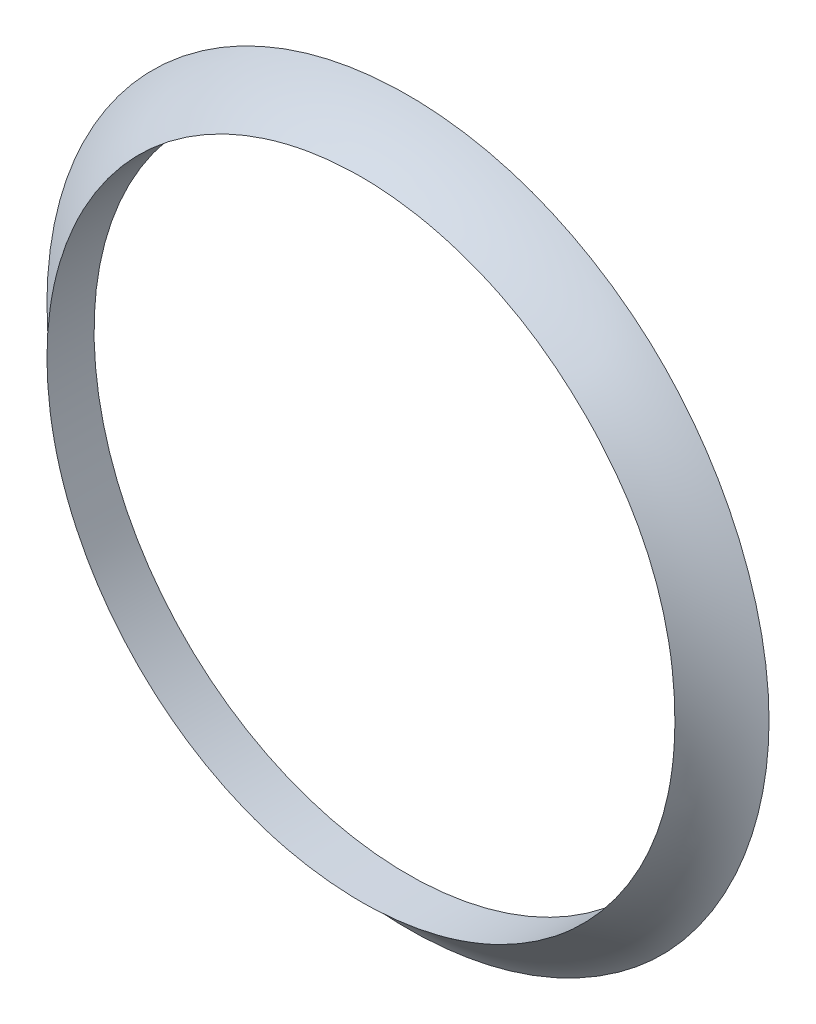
ISO-10303-21;
HEADER;
FILE_DESCRIPTION(('STEP AP214'),'2;1');
FILE_NAME('part.step','',(''),(''),'','','');
FILE_SCHEMA(('AUTOMOTIVE_DESIGN { 1 0 10303 214 1 1 1 1 }'));
ENDSEC;
DATA;
#1=APPLICATION_CONTEXT('core data for automotive mechanical design processes');
#2=APPLICATION_PROTOCOL_DEFINITION('international standard','automotive_design',2000,#1);
#3=PRODUCT_CONTEXT('',#1,'mechanical');
#4=PRODUCT('Part','Part','',(#3));
#5=PRODUCT_RELATED_PRODUCT_CATEGORY('part','',(#4));
#6=PRODUCT_DEFINITION_FORMATION('','',#4);
#7=PRODUCT_DEFINITION_CONTEXT('part definition',#1,'design');
#8=PRODUCT_DEFINITION('design','',#6,#7);
#9=PRODUCT_DEFINITION_SHAPE('','',#8);
#10=(LENGTH_UNIT() NAMED_UNIT(*) SI_UNIT(.MILLI.,.METRE.));
#11=(NAMED_UNIT(*) PLANE_ANGLE_UNIT() SI_UNIT($,.RADIAN.));
#12=(NAMED_UNIT(*) SI_UNIT($,.STERADIAN.) SOLID_ANGLE_UNIT());
#13=UNCERTAINTY_MEASURE_WITH_UNIT(LENGTH_MEASURE(1.E-05),#10,'distance_accuracy_value','');
#14=(GEOMETRIC_REPRESENTATION_CONTEXT(3) GLOBAL_UNCERTAINTY_ASSIGNED_CONTEXT((#13)) GLOBAL_UNIT_ASSIGNED_CONTEXT((#10,
#11,#12)) REPRESENTATION_CONTEXT('',''));
#15=CARTESIAN_POINT('',(0.,0.,0.));
#16=DIRECTION('',(0.,0.,1.));
#17=DIRECTION('',(1.,0.,0.));
#18=AXIS2_PLACEMENT_3D('',#15,#16,#17);
#19=CARTESIAN_POINT('',(718.031944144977,689.142048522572,-152.499999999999));
#20=DIRECTION('',(0.,0.,-0.999999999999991));
#21=DIRECTION('',(-0.453546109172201,0.89123281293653,0.));
#22=AXIS2_PLACEMENT_3D('',#19,#20,#21);
#23=CYLINDRICAL_SURFACE('',#22,20.);
#24=CARTESIAN_POINT('',(738.031944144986,689.142048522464,-160.999999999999));
#25=CARTESIAN_POINT('',(738.031940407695,688.581115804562,-160.999998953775));
#26=CARTESIAN_POINT('',(738.00832523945,688.020078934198,-161.003315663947));
#27=CARTESIAN_POINT('',(737.914015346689,686.901908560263,-161.013238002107));
#28=CARTESIAN_POINT('',(737.843307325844,686.344776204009,-161.019844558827));
#29=CARTESIAN_POINT('',(737.655207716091,685.237812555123,-161.033482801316));
#30=CARTESIAN_POINT('',(737.537764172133,684.687990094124,-161.040514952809));
#31=CARTESIAN_POINT('',(737.257003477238,683.600158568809,-161.052818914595));
#32=CARTESIAN_POINT('',(737.093689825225,683.062148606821,-161.058090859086));
#33=CARTESIAN_POINT('',(736.784244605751,682.178451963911,-161.06428323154));
#34=CARTESIAN_POINT('',(736.650499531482,681.828378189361,-161.066068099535));
#35=CARTESIAN_POINT('',(736.363547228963,681.136260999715,-161.068065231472));
#36=CARTESIAN_POINT('',(736.210339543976,680.794217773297,-161.068277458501));
#37=CARTESIAN_POINT('',(735.884958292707,680.119285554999,-161.067093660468));
#38=CARTESIAN_POINT('',(735.712784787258,679.78639653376,-161.065697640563));
#39=CARTESIAN_POINT('',(735.350056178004,679.13089097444,-161.061440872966));
#40=CARTESIAN_POINT('',(735.159505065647,678.808272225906,-161.058580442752));
#41=CARTESIAN_POINT('',(734.760594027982,678.174252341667,-161.05171652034));
#42=CARTESIAN_POINT('',(734.552234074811,677.862851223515,-161.047713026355));
#43=CARTESIAN_POINT('',(734.118361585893,677.252244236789,-161.039071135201));
#44=CARTESIAN_POINT('',(733.892848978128,676.953038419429,-161.034432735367));
#45=CARTESIAN_POINT('',(733.425571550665,676.368001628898,-161.025225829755));
#46=CARTESIAN_POINT('',(733.183820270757,676.082159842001,-161.020657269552));
#47=CARTESIAN_POINT('',(732.684655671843,675.524483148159,-161.012474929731));
#48=CARTESIAN_POINT('',(732.42724245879,675.252648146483,-161.008861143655));
#49=CARTESIAN_POINT('',(731.897560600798,674.723840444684,-161.003670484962));
#50=CARTESIAN_POINT('',(731.62529209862,674.466867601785,-161.002093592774));
#51=CARTESIAN_POINT('',(731.066762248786,673.968598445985,-161.000429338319));
#52=CARTESIAN_POINT('',(730.780500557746,673.727302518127,-161.000342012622));
#53=CARTESIAN_POINT('',(730.194869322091,673.261138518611,-161.000853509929));
#54=CARTESIAN_POINT('',(729.895499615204,673.036270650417,-161.001452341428));
#55=CARTESIAN_POINT('',(729.437372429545,672.711855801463,-161.002099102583));
#56=CARTESIAN_POINT('',(729.283145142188,672.605861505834,-161.002272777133));
#57=CARTESIAN_POINT('',(728.971774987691,672.398239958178,-161.002417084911));
#58=CARTESIAN_POINT('',(728.814632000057,672.296612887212,-161.00238770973));
#59=CARTESIAN_POINT('',(728.180116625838,671.898786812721,-161.00192333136));
#60=CARTESIAN_POINT('',(727.691428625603,671.620344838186,-161.000794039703));
#61=CARTESIAN_POINT('',(726.692365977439,671.105616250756,-160.9978864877));
#62=CARTESIAN_POINT('',(726.181991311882,670.869329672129,-160.996108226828));
#63=CARTESIAN_POINT('',(725.402982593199,670.547781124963,-160.993989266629));
#64=CARTESIAN_POINT('',(725.14104182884,670.446068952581,-160.993374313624));
#65=CARTESIAN_POINT('',(724.613107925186,670.253766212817,-160.992469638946));
#66=CARTESIAN_POINT('',(724.347114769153,670.163175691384,-160.992179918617));
#67=CARTESIAN_POINT('',(723.543792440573,669.908352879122,-160.991914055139));
#68=CARTESIAN_POINT('',(723.001003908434,669.761021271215,-160.992540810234));
#69=CARTESIAN_POINT('',(721.904621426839,669.512517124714,-160.994996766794));
#70=CARTESIAN_POINT('',(721.351021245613,669.411372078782,-160.996826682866));
#71=CARTESIAN_POINT('',(720.515840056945,669.294898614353,-160.998724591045));
#72=CARTESIAN_POINT('',(720.236618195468,669.261946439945,-160.999216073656));
#73=CARTESIAN_POINT('',(719.677015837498,669.207838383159,-160.999874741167));
#74=CARTESIAN_POINT('',(719.396635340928,669.18668250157,-161.000041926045));
#75=CARTESIAN_POINT('',(718.835236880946,669.156209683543,-161.00013091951));
#76=CARTESIAN_POINT('',(718.554218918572,669.146892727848,-161.000052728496));
#77=CARTESIAN_POINT('',(717.992038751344,669.14011292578,-161.000001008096));
#78=CARTESIAN_POINT('',(717.710876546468,669.142650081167,-161.000027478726));
#79=CARTESIAN_POINT('',(717.148909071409,669.159574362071,-161.000030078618));
#80=CARTESIAN_POINT('',(716.86810380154,669.17396149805,-161.000006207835));
#81=CARTESIAN_POINT('',(716.30734952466,669.214560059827,-160.999667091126));
#82=CARTESIAN_POINT('',(716.027400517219,669.240771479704,-160.999351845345));
#83=CARTESIAN_POINT('',(715.468845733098,669.304973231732,-160.998418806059));
#84=CARTESIAN_POINT('',(715.190240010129,669.34296403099,-160.997801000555));
#85=CARTESIAN_POINT('',(714.634878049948,669.430656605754,-160.996398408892));
#86=CARTESIAN_POINT('',(714.358121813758,669.48035838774,-160.99561362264));
#87=CARTESIAN_POINT('',(713.806950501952,669.591384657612,-160.994240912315));
#88=CARTESIAN_POINT('',(713.532535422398,669.652709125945,-160.99365298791));
#89=CARTESIAN_POINT('',(712.986534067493,669.786871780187,-160.992813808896));
#90=CARTESIAN_POINT('',(712.714947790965,669.859709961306,-160.992562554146));
#91=CARTESIAN_POINT('',(712.175086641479,670.016770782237,-160.992411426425));
#92=CARTESIAN_POINT('',(711.906811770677,670.100993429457,-160.992511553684));
#93=CARTESIAN_POINT('',(711.374052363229,670.28067238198,-160.993014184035));
#94=CARTESIAN_POINT('',(711.10956782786,670.376128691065,-160.993416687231));
#95=CARTESIAN_POINT('',(710.58485333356,670.578108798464,-160.994384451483));
#96=CARTESIAN_POINT('',(710.32462338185,670.684632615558,-160.994949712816));
#97=CARTESIAN_POINT('',(709.808901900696,670.908545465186,-160.996079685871));
#98=CARTESIAN_POINT('',(709.553410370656,671.025934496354,-160.996644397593));
#99=CARTESIAN_POINT('',(708.794717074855,671.394104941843,-160.998304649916));
#100=CARTESIAN_POINT('',(708.299182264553,671.660933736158,-160.999366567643));
#101=CARTESIAN_POINT('',(707.332419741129,672.235350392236,-161.001365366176));
#102=CARTESIAN_POINT('',(706.861192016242,672.54293823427,-161.002302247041));
#103=CARTESIAN_POINT('',(705.946303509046,673.196724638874,-161.004074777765));
#104=CARTESIAN_POINT('',(705.502642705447,673.542923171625,-161.004910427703));
#105=CARTESIAN_POINT('',(704.646065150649,674.271460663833,-161.006077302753));
#106=CARTESIAN_POINT('',(704.233148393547,674.653799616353,-161.006408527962));
#107=CARTESIAN_POINT('',(703.440971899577,675.451917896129,-161.006349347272));
#108=CARTESIAN_POINT('',(703.06171360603,675.867698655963,-161.005958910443));
#109=CARTESIAN_POINT('',(702.339569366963,676.729735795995,-161.004707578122));
#110=CARTESIAN_POINT('',(701.996683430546,677.175992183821,-161.003846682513));
#111=CARTESIAN_POINT('',(701.349730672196,678.09578462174,-161.002047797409));
#112=CARTESIAN_POINT('',(701.045663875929,678.569320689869,-161.001109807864));
#113=CARTESIAN_POINT('',(700.478473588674,679.540396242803,-160.999095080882));
#114=CARTESIAN_POINT('',(700.215350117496,680.037935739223,-160.998018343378));
#115=CARTESIAN_POINT('',(699.852853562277,680.799399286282,-160.99634478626));
#116=CARTESIAN_POINT('',(699.737374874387,681.055776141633,-160.995777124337));
#117=CARTESIAN_POINT('',(699.517319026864,681.573187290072,-160.994655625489));
#118=CARTESIAN_POINT('',(699.412741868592,681.834221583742,-160.994101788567));
#119=CARTESIAN_POINT('',(699.214687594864,682.360462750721,-160.993191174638));
#120=CARTESIAN_POINT('',(699.121210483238,682.625669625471,-160.992834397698));
#121=CARTESIAN_POINT('',(698.945519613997,683.1597887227,-160.992438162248));
#122=CARTESIAN_POINT('',(698.863305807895,683.428700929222,-160.992398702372));
#123=CARTESIAN_POINT('',(698.710288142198,683.969752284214,-160.992672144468));
#124=CARTESIAN_POINT('',(698.639484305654,684.241891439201,-160.992985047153));
#125=CARTESIAN_POINT('',(698.509412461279,684.788912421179,-160.993945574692));
#126=CARTESIAN_POINT('',(698.450144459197,685.063794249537,-160.994593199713));
#127=CARTESIAN_POINT('',(698.343249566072,685.6158120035,-160.996023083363));
#128=CARTESIAN_POINT('',(698.295622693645,685.89294793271,-160.996805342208));
#129=CARTESIAN_POINT('',(698.212094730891,686.448982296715,-160.998161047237));
#130=CARTESIAN_POINT('',(698.176193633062,686.727880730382,-160.998734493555));
#131=CARTESIAN_POINT('',(698.116182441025,687.286928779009,-160.999565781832));
#132=CARTESIAN_POINT('',(698.092071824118,687.567078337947,-160.999823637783));
#133=CARTESIAN_POINT('',(698.055682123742,688.128154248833,-161.000074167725));
#134=CARTESIAN_POINT('',(698.043403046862,688.409080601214,-161.000066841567));
#135=CARTESIAN_POINT('',(698.03387434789,688.830653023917,-161.000022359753));
#136=CARTESIAN_POINT('',(698.032179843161,688.9712115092,-161.000001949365));
#137=CARTESIAN_POINT('',(698.031754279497,689.252332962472,-160.999998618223));
#138=CARTESIAN_POINT('',(698.033023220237,689.39289593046,-161.000015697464));
#139=CARTESIAN_POINT('',(698.041275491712,689.814494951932,-161.000060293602));
#140=CARTESIAN_POINT('',(698.052703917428,690.095456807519,-161.000081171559));
#141=CARTESIAN_POINT('',(698.087394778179,690.656640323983,-160.999866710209));
#142=CARTESIAN_POINT('',(698.110657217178,690.936861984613,-160.999631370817));
#143=CARTESIAN_POINT('',(698.168973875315,691.496075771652,-160.998843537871));
#144=CARTESIAN_POINT('',(698.204028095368,691.775067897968,-160.998291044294));
#145=CARTESIAN_POINT('',(698.285868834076,692.331331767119,-160.996963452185));
#146=CARTESIAN_POINT('',(698.332655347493,692.608603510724,-160.996188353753));
#147=CARTESIAN_POINT('',(698.437866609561,693.160903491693,-160.994742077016));
#148=CARTESIAN_POINT('',(698.496291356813,693.435931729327,-160.9940708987));
#149=CARTESIAN_POINT('',(698.688901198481,694.256978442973,-160.992569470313));
#150=CARTESIAN_POINT('',(698.840439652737,694.799079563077,-160.992250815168));
#151=CARTESIAN_POINT('',(699.101515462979,695.600997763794,-160.992768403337));
#152=CARTESIAN_POINT('',(699.194180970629,695.866460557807,-160.993106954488));
#153=CARTESIAN_POINT('',(699.390617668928,696.393252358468,-160.993992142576));
#154=CARTESIAN_POINT('',(699.494388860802,696.654581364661,-160.994538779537));
#155=CARTESIAN_POINT('',(699.822091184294,697.431630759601,-160.996208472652));
#156=CARTESIAN_POINT('',(700.062449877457,697.940532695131,-160.997361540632));
#157=CARTESIAN_POINT('',(700.585152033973,698.936215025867,-160.99950362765));
#158=CARTESIAN_POINT('',(700.867495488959,699.422995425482,-161.000492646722));
#159=CARTESIAN_POINT('',(701.472183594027,700.371046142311,-161.002415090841));
#160=CARTESIAN_POINT('',(701.79452710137,700.832317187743,-161.003348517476));
#161=CARTESIAN_POINT('',(702.476921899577,701.726062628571,-161.004972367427));
#162=CARTESIAN_POINT('',(702.836973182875,702.158537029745,-161.005662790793));
#163=CARTESIAN_POINT('',(703.592226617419,702.991621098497,-161.006413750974));
#164=CARTESIAN_POINT('',(703.98742875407,703.392230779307,-161.00647428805));
#165=CARTESIAN_POINT('',(704.810173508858,704.158735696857,-161.005924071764));
#166=CARTESIAN_POINT('',(705.237716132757,704.524630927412,-161.00531331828));
#167=CARTESIAN_POINT('',(706.122120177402,705.219119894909,-161.003778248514));
#168=CARTESIAN_POINT('',(706.578982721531,705.547712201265,-161.00285392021));
#169=CARTESIAN_POINT('',(707.518762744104,706.165243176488,-161.000960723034));
#170=CARTESIAN_POINT('',(708.001680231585,706.454181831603,-160.999991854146));
#171=CARTESIAN_POINT('',(708.990143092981,706.99035232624,-160.997897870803));
#172=CARTESIAN_POINT('',(709.495688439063,707.237584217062,-160.996772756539));
#173=CARTESIAN_POINT('',(710.525787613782,707.688578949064,-160.994500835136));
#174=CARTESIAN_POINT('',(711.050341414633,707.892341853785,-160.993354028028));
#175=CARTESIAN_POINT('',(712.114848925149,708.254977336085,-160.992285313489));
#176=CARTESIAN_POINT('',(712.654803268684,708.413848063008,-160.992363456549));
#177=CARTESIAN_POINT('',(713.473179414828,708.617592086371,-160.99353644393));
#178=CARTESIAN_POINT('',(713.747410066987,708.679751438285,-160.994103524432));
#179=CARTESIAN_POINT('',(714.298266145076,708.792459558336,-160.995453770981));
#180=CARTESIAN_POINT('',(714.574891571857,708.843008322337,-160.996236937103));
#181=CARTESIAN_POINT('',(715.130023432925,708.932397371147,-160.997657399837));
#182=CARTESIAN_POINT('',(715.408529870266,708.971237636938,-160.998294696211));
#183=CARTESIAN_POINT('',(715.966934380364,709.037142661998,-160.999269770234));
#184=CARTESIAN_POINT('',(716.246832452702,709.064207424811,-160.999607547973));
#185=CARTESIAN_POINT('',(716.807520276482,709.106512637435,-160.999987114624));
#186=CARTESIAN_POINT('',(717.088310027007,709.121753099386,-161.000028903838));
#187=CARTESIAN_POINT('',(717.650282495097,709.140382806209,-161.000032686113));
#188=CARTESIAN_POINT('',(717.9314652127,709.143772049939,-160.999994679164));
#189=CARTESIAN_POINT('',(718.493710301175,709.138693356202,-161.000041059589));
#190=CARTESIAN_POINT('',(718.774772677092,709.130225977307,-161.000125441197));
#191=CARTESIAN_POINT('',(719.336290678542,709.101450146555,-161.000065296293));
#192=CARTESIAN_POINT('',(719.616746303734,709.08114168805,-160.999920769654));
#193=CARTESIAN_POINT('',(720.176552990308,709.028719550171,-160.99930663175));
#194=CARTESIAN_POINT('',(720.455904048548,708.996605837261,-160.998837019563));
#195=CARTESIAN_POINT('',(721.013000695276,708.920631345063,-160.997613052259));
#196=CARTESIAN_POINT('',(721.290746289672,708.876770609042,-160.996858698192));
#197=CARTESIAN_POINT('',(721.84414763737,708.77737697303,-160.995323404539));
#198=CARTESIAN_POINT('',(722.119803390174,708.721844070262,-160.994542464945));
#199=CARTESIAN_POINT('',(722.668511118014,708.599214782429,-160.993262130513));
#200=CARTESIAN_POINT('',(722.941563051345,708.532118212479,-160.992762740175));
#201=CARTESIAN_POINT('',(723.756113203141,708.313634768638,-160.991836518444));
#202=CARTESIAN_POINT('',(724.293135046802,708.145030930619,-160.991981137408));
#203=CARTESIAN_POINT('',(725.174573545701,707.826896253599,-160.993396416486));
#204=CARTESIAN_POINT('',(725.523540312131,707.689731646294,-160.994275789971));
#205=CARTESIAN_POINT('',(726.213249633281,707.395997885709,-160.996276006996));
#206=CARTESIAN_POINT('',(726.553992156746,707.239428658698,-160.997396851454));
#207=CARTESIAN_POINT('',(727.226125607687,706.90739573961,-160.999468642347));
#208=CARTESIAN_POINT('',(727.557516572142,706.731932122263,-161.000419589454));
#209=CARTESIAN_POINT('',(728.20992075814,706.362654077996,-161.001827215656));
#210=CARTESIAN_POINT('',(728.53093445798,706.168840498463,-161.002283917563));
#211=CARTESIAN_POINT('',(729.003871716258,705.864845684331,-161.002408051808));
#212=CARTESIAN_POINT('',(729.160094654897,705.761296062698,-161.002355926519));
#213=CARTESIAN_POINT('',(729.469569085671,705.549847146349,-161.002074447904));
#214=CARTESIAN_POINT('',(729.622820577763,705.44194785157,-161.001845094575));
#215=CARTESIAN_POINT('',(730.077925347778,705.111857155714,-161.001119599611));
#216=CARTESIAN_POINT('',(730.375161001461,704.883252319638,-161.00058598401));
#217=CARTESIAN_POINT('',(730.956316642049,704.409697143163,-161.000388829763));
#218=CARTESIAN_POINT('',(731.24023657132,704.164746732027,-161.000725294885));
#219=CARTESIAN_POINT('',(731.655428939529,703.785675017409,-161.002440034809));
#220=CARTESIAN_POINT('',(731.792051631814,703.657370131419,-161.003213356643));
#221=CARTESIAN_POINT('',(732.061635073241,703.396973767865,-161.005248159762));
#222=CARTESIAN_POINT('',(732.194595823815,703.264882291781,-161.006509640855));
#223=CARTESIAN_POINT('',(732.58782133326,702.863086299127,-161.010987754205));
#224=CARTESIAN_POINT('',(732.842455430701,702.587836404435,-161.014898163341));
#225=CARTESIAN_POINT('',(733.335892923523,702.023419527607,-161.023464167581));
#226=CARTESIAN_POINT('',(733.574692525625,701.734249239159,-161.028119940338));
#227=CARTESIAN_POINT('',(734.035666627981,701.142939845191,-161.037337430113));
#228=CARTESIAN_POINT('',(734.257841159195,700.840800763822,-161.041899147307));
#229=CARTESIAN_POINT('',(734.684857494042,700.224512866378,-161.050262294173));
#230=CARTESIAN_POINT('',(734.889699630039,699.910364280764,-161.054063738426));
#231=CARTESIAN_POINT('',(735.281381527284,699.271086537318,-161.060437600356));
#232=CARTESIAN_POINT('',(735.468223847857,698.945958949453,-161.063010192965));
#233=CARTESIAN_POINT('',(735.823349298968,698.28570310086,-161.066643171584));
#234=CARTESIAN_POINT('',(735.991631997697,697.950574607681,-161.067703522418));
#235=CARTESIAN_POINT('',(736.309107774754,697.271367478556,-161.068207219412));
#236=CARTESIAN_POINT('',(736.45829965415,696.927288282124,-161.067650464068));
#237=CARTESIAN_POINT('',(736.736957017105,696.23166951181,-161.064989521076));
#238=CARTESIAN_POINT('',(736.866443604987,695.880138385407,-161.062887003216));
#239=CARTESIAN_POINT('',(737.10546605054,695.170395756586,-161.057373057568));
#240=CARTESIAN_POINT('',(737.215003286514,694.812184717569,-161.053961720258));
#241=CARTESIAN_POINT('',(737.413767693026,694.09028429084,-161.046231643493));
#242=CARTESIAN_POINT('',(737.503000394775,693.726596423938,-161.041913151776));
#243=CARTESIAN_POINT('',(737.656667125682,693.014477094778,-161.03317069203));
#244=CARTESIAN_POINT('',(737.722176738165,692.666277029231,-161.028764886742));
#245=CARTESIAN_POINT('',(737.834623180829,691.96683025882,-161.020241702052));
#246=CARTESIAN_POINT('',(737.881557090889,691.615583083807,-161.016124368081));
#247=CARTESIAN_POINT('',(737.956696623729,690.911137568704,-161.008887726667));
#248=CARTESIAN_POINT('',(737.984905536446,690.557939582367,-161.005768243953));
#249=CARTESIAN_POINT('',(738.022531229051,689.850524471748,-161.001324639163));
#250=CARTESIAN_POINT('',(738.031946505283,689.49630726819,-161.000000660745));
#251=CARTESIAN_POINT('',(738.031944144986,689.142048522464,-160.999999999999));
#252=B_SPLINE_CURVE_WITH_KNOTS('',3,(#24,#25,#26,#27,#28,#29,#30,#31,#32,#33,#34,#35,#36,#37,
#38,#39,#40,#41,#42,#43,#44,#45,#46,#47,#48,#49,#50,#51,#52,#53,#54,#55,#56,#57,#58,#59,#60,#61,
#62,#63,#64,#65,#66,#67,#68,#69,#70,#71,#72,#73,#74,#75,#76,#77,#78,#79,#80,#81,#82,#83,#84,#85,
#86,#87,#88,#89,#90,#91,#92,#93,#94,#95,#96,#97,#98,#99,#100,#101,#102,#103,#104,#105,#106,#107,
#108,#109,#110,#111,#112,#113,#114,#115,#116,#117,#118,#119,#120,#121,#122,#123,#124,#125,#126,
#127,#128,#129,#130,#131,#132,#133,#134,#135,#136,#137,#138,#139,#140,#141,#142,#143,#144,#145,
#146,#147,#148,#149,#150,#151,#152,#153,#154,#155,#156,#157,#158,#159,#160,#161,#162,#163,#164,
#165,#166,#167,#168,#169,#170,#171,#172,#173,#174,#175,#176,#177,#178,#179,#180,#181,#182,#183,
#184,#185,#186,#187,#188,#189,#190,#191,#192,#193,#194,#195,#196,#197,#198,#199,#200,#201,#202,
#203,#204,#205,#206,#207,#208,#209,#210,#211,#212,#213,#214,#215,#216,#217,#218,#219,#220,#221,
#222,#223,#224,#225,#226,#227,#228,#229,#230,#231,#232,#233,#234,#235,#236,#237,#238,#239,#240,
#241,#242,#243,#244,#245,#246,#247,#248,#249,#250,#251),.UNSPECIFIED.,.T.,.F.,(4,2,2,2,2,2,2,2,
2,2,2,2,2,2,2,2,2,2,2,2,2,2,2,2,2,2,2,2,2,2,2,2,2,2,2,2,2,2,2,2,2,2,2,2,2,2,2,2,2,2,2,2,2,2,2,2,
2,2,2,2,2,2,2,2,2,2,2,2,2,2,2,2,2,2,2,2,2,2,2,2,2,2,2,2,2,2,2,2,2,2,2,2,2,2,2,2,2,2,2,2,2,2,2,2,
2,2,2,2,2,2,2,2,2,4),(0.,1.68248513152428,3.36544550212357,5.05028203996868,6.73499009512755,
7.85871906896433,8.98247441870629,10.1062261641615,11.2297343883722,12.3532443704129,
13.4767590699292,14.5993483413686,15.721930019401,16.8445009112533,17.9670993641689,
19.0897117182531,19.6510611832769,20.2124338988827,21.8975910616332,23.5827495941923,
24.4255175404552,25.2682889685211,26.9534549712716,28.6396227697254,29.4828942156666,
30.326165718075,31.1694358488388,32.0127061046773,32.8559771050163,33.6992476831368,
34.5425517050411,35.3858561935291,36.2291592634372,37.0724619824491,37.9157652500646,
38.7590688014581,39.6023737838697,40.445678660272,42.1319220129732,43.8181645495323,
45.5044057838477,47.1906466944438,48.8769598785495,50.5632734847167,52.2495882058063,
53.9359037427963,54.7792529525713,55.6226022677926,56.4659518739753,57.3092978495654,
58.1526455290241,58.9959936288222,59.8393430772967,60.6826919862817,61.5260035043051,
62.3693154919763,62.7909946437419,63.2126737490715,64.05598493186,64.8992963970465,
65.7426079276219,66.5859190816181,67.4292301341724,69.1154875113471,69.9588042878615,
70.8021211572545,72.4883801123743,74.1746387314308,75.8608491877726,77.5470593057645,
79.2332687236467,80.9194784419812,82.6057528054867,84.2920277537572,85.9783006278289,
87.664571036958,89.3509109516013,90.1942697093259,91.037628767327,91.8809891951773,
92.724349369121,93.567708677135,94.4110680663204,95.2543877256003,96.0977078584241,
96.9410303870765,97.7843498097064,98.6276694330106,99.4710025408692,101.157275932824,
102.281636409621,103.406001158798,104.530361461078,105.654669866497,106.216881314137,
106.779092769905,107.903401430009,109.0277149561,109.589927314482,110.152139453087,
111.276457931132,112.401044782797,113.525629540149,114.650192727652,115.774595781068,
116.899024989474,118.023524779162,119.146811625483,120.27002083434,121.392923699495,
122.455437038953,123.518117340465,124.580610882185,125.643189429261),.UNSPECIFIED.);
#253=CARTESIAN_POINT('',(738.031944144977,689.142048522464,-160.999999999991));
#254=VERTEX_POINT('',#253);
#255=EDGE_CURVE('E61',#254,#254,#252,.T.);
#256=ORIENTED_EDGE('',*,*,#255,.F.);
#257=EDGE_LOOP('',(#256));
#258=FACE_BOUND('',#257,.T.);
#259=CARTESIAN_POINT('',(718.031944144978,689.142048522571,-163.999999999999));
#260=DIRECTION('',(0.,0.,0.999999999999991));
#261=DIRECTION('',(0.453546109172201,-0.89123281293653,0.));
#262=AXIS2_PLACEMENT_3D('',#259,#260,#261);
#263=CIRCLE('',#262,20.);
#264=CARTESIAN_POINT('',(727.102866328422,671.317392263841,-163.999999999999));
#265=VERTEX_POINT('',#264);
#266=EDGE_CURVE('E71',#265,#265,#263,.T.);
#267=ORIENTED_EDGE('',*,*,#266,.F.);
#268=EDGE_LOOP('',(#267));
#269=FACE_BOUND('',#268,.T.);
#270=ADVANCED_FACE('F54',(#258,#269),#23,.F.);
#271=CARTESIAN_POINT('',(614.509309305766,782.32500874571,-163.999999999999));
#272=DIRECTION('',(0.,0.,0.999999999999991));
#273=DIRECTION('',(0.453546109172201,-0.89123281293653,0.));
#274=AXIS2_PLACEMENT_3D('',#271,#272,#273);
#275=PLANE('',#274);
#276=CARTESIAN_POINT('',(741.031944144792,689.142048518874,-163.999999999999));
#277=CARTESIAN_POINT('',(741.031951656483,689.764577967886,-163.999999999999));
#278=CARTESIAN_POINT('',(741.004480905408,690.386988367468,-163.999999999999));
#279=CARTESIAN_POINT('',(740.89689482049,691.627438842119,-163.999999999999));
#280=CARTESIAN_POINT('',(740.816762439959,692.245477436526,-163.999999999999));
#281=CARTESIAN_POINT('',(740.605957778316,693.474176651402,-163.999999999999));
#282=CARTESIAN_POINT('',(740.475176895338,694.084818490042,-163.999999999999));
#283=CARTESIAN_POINT('',(740.165321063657,695.293695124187,-163.999999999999));
#284=CARTESIAN_POINT('',(739.986249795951,695.891930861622,-163.999999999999));
#285=CARTESIAN_POINT('',(739.649697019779,696.874463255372,-163.999999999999));
#286=CARTESIAN_POINT('',(739.505108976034,697.263235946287,-163.999999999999));
#287=CARTESIAN_POINT('',(739.196020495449,698.032805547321,-163.999999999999));
#288=CARTESIAN_POINT('',(739.03152010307,698.413602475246,-163.999999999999));
#289=CARTESIAN_POINT('',(738.683097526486,699.166200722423,-163.999999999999));
#290=CARTESIAN_POINT('',(738.499175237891,699.538001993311,-163.999999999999));
#291=CARTESIAN_POINT('',(738.11256086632,700.27118736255,-163.999999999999));
#292=CARTESIAN_POINT('',(737.909889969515,700.632582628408,-163.999999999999));
#293=CARTESIAN_POINT('',(737.486001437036,701.344335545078,-163.999999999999));
#294=CARTESIAN_POINT('',(737.264783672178,701.694693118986,-163.999999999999));
#295=CARTESIAN_POINT('',(736.804149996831,702.383293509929,-163.999999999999));
#296=CARTESIAN_POINT('',(736.564732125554,702.721535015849,-163.999999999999));
#297=CARTESIAN_POINT('',(736.047747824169,703.411821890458,-163.999999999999));
#298=CARTESIAN_POINT('',(735.768662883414,703.762731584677,-163.999999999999));
#299=CARTESIAN_POINT('',(735.190079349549,704.447357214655,-163.999999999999));
#300=CARTESIAN_POINT('',(734.890580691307,704.781073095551,-163.999999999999));
#301=CARTESIAN_POINT('',(734.426459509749,705.267342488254,-163.999999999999));
#302=CARTESIAN_POINT('',(734.269274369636,705.427047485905,-163.999999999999));
#303=CARTESIAN_POINT('',(733.950037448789,705.74151676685,-163.999999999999));
#304=CARTESIAN_POINT('',(733.787985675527,705.896281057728,-163.999999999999));
#305=CARTESIAN_POINT('',(733.294683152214,706.353148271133,-163.999999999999));
#306=CARTESIAN_POINT('',(732.956396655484,706.647708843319,-163.999999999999));
#307=CARTESIAN_POINT('',(732.262714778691,707.216033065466,-163.999999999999));
#308=CARTESIAN_POINT('',(731.907316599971,707.489793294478,-163.999999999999));
#309=CARTESIAN_POINT('',(731.362751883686,707.88451235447,-163.999999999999));
#310=CARTESIAN_POINT('',(731.179311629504,708.013436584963,-163.999999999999));
#311=CARTESIAN_POINT('',(730.808780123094,708.26600744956,-163.999999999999));
#312=CARTESIAN_POINT('',(730.621688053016,708.389652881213,-163.999999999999));
#313=CARTESIAN_POINT('',(729.900347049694,708.851670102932,-163.999999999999));
#314=CARTESIAN_POINT('',(729.353917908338,709.171336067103,-163.999999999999));
#315=CARTESIAN_POINT('',(728.236839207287,709.765019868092,-163.999999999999));
#316=CARTESIAN_POINT('',(727.666188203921,710.039034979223,-163.999999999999));
#317=CARTESIAN_POINT('',(726.504327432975,710.538692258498,-163.999999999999));
#318=CARTESIAN_POINT('',(725.913126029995,710.764353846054,-163.999999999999));
#319=CARTESIAN_POINT('',(724.713726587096,711.165209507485,-163.999999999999));
#320=CARTESIAN_POINT('',(724.105527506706,711.340400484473,-163.999999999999));
#321=CARTESIAN_POINT('',(723.178288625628,711.565852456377,-163.999999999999));
#322=CARTESIAN_POINT('',(722.863776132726,711.635237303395,-163.999999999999));
#323=CARTESIAN_POINT('',(722.232080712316,711.760643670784,-163.999999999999));
#324=CARTESIAN_POINT('',(721.914897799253,711.816665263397,-163.999999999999));
#325=CARTESIAN_POINT('',(721.278477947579,711.915478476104,-163.999999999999));
#326=CARTESIAN_POINT('',(720.959240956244,711.958269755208,-163.999999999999));
#327=CARTESIAN_POINT('',(720.319269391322,712.030635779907,-163.999999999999));
#328=CARTESIAN_POINT('',(719.998534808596,712.060210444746,-163.999999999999));
#329=CARTESIAN_POINT('',(719.356002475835,712.106084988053,-163.999999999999));
#330=CARTESIAN_POINT('',(719.034204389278,712.122380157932,-163.999999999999));
#331=CARTESIAN_POINT('',(718.39021087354,712.141473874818,-163.999999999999));
#332=CARTESIAN_POINT('',(718.068015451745,712.144272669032,-163.999999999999));
#333=CARTESIAN_POINT('',(717.423792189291,712.136260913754,-163.999999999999));
#334=CARTESIAN_POINT('',(717.101764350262,712.125450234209,-163.999999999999));
#335=CARTESIAN_POINT('',(716.458429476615,712.0904769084,-163.999999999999));
#336=CARTESIAN_POINT('',(716.137122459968,712.066313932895,-163.999999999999));
#337=CARTESIAN_POINT('',(715.492671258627,712.004429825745,-163.999999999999));
#338=CARTESIAN_POINT('',(715.169539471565,711.966579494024,-163.999999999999));
#339=CARTESIAN_POINT('',(714.525146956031,711.877387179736,-163.999999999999));
#340=CARTESIAN_POINT('',(714.203886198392,711.826045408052,-163.999999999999));
#341=CARTESIAN_POINT('',(713.563849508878,711.709759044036,-163.999999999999));
#342=CARTESIAN_POINT('',(713.245073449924,711.644815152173,-163.999999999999));
#343=CARTESIAN_POINT('',(712.610610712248,711.501246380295,-163.999999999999));
#344=CARTESIAN_POINT('',(712.294924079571,711.422621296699,-163.999999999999));
#345=CARTESIAN_POINT('',(711.667343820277,711.251845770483,-163.999999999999));
#346=CARTESIAN_POINT('',(711.355448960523,711.15969985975,-163.999999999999));
#347=CARTESIAN_POINT('',(710.73592212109,710.962046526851,-163.999999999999));
#348=CARTESIAN_POINT('',(710.428290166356,710.856539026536,-163.999999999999));
#349=CARTESIAN_POINT('',(709.817853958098,710.632429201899,-163.999999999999));
#350=CARTESIAN_POINT('',(709.515049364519,710.513827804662,-163.999999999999));
#351=CARTESIAN_POINT('',(708.914696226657,710.263848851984,-163.999999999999));
#352=CARTESIAN_POINT('',(708.617149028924,710.132468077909,-163.999999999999));
#353=CARTESIAN_POINT('',(707.74024394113,709.722843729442,-163.999999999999));
#354=CARTESIAN_POINT('',(707.169254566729,709.42640469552,-163.999999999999));
#355=CARTESIAN_POINT('',(706.054117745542,708.786878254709,-163.999999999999));
#356=CARTESIAN_POINT('',(705.509970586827,708.443790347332,-163.999999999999));
#357=CARTESIAN_POINT('',(704.452115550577,707.71316196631,-163.999999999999));
#358=CARTESIAN_POINT('',(703.938416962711,707.325608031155,-163.999999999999));
#359=CARTESIAN_POINT('',(702.945085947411,706.509039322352,-163.999999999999));
#360=CARTESIAN_POINT('',(702.465455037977,706.080022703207,-163.999999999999));
#361=CARTESIAN_POINT('',(701.539315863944,705.179627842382,-163.999999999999));
#362=CARTESIAN_POINT('',(701.093143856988,704.707903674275,-163.999999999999));
#363=CARTESIAN_POINT('',(700.241973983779,703.728676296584,-163.999999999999));
#364=CARTESIAN_POINT('',(699.836974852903,703.221174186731,-163.999999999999));
#365=CARTESIAN_POINT('',(699.071357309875,702.173979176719,-163.999999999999));
#366=CARTESIAN_POINT('',(698.710726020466,701.634295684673,-163.999999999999));
#367=CARTESIAN_POINT('',(698.036235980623,700.526314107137,-163.999999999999));
#368=CARTESIAN_POINT('',(697.722379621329,699.958014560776,-163.999999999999));
#369=CARTESIAN_POINT('',(697.288262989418,699.087005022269,-163.999999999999));
#370=CARTESIAN_POINT('',(697.14957530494,698.793339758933,-163.999999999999));
#371=CARTESIAN_POINT('',(696.884740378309,698.200389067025,-163.999999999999));
#372=CARTESIAN_POINT('',(696.758592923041,697.901103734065,-163.999999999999));
#373=CARTESIAN_POINT('',(696.519169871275,697.297455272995,-163.999999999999));
#374=CARTESIAN_POINT('',(696.405893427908,696.993092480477,-163.999999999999));
#375=CARTESIAN_POINT('',(696.192515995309,696.37977964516,-163.999999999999));
#376=CARTESIAN_POINT('',(696.092415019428,696.070829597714,-163.999999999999));
#377=CARTESIAN_POINT('',(695.905603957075,695.448848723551,-163.999999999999));
#378=CARTESIAN_POINT('',(695.8188962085,695.135817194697,-163.999999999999));
#379=CARTESIAN_POINT('',(695.659039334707,694.506272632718,-163.999999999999));
#380=CARTESIAN_POINT('',(695.585891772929,694.189759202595,-163.999999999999));
#381=CARTESIAN_POINT('',(695.45324096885,693.553870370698,-163.999999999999));
#382=CARTESIAN_POINT('',(695.393738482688,693.234494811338,-163.999999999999));
#383=CARTESIAN_POINT('',(695.288240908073,692.593558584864,-163.999999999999));
#384=CARTESIAN_POINT('',(695.242244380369,692.271998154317,-163.999999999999));
#385=CARTESIAN_POINT('',(695.164160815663,691.631022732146,-163.999999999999));
#386=CARTESIAN_POINT('',(695.131916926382,691.311626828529,-163.999999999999));
#387=CARTESIAN_POINT('',(695.080612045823,690.671782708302,-163.999999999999));
#388=CARTESIAN_POINT('',(695.061550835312,690.351334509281,-163.999999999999));
#389=CARTESIAN_POINT('',(695.036759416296,689.709923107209,-163.999999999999));
#390=CARTESIAN_POINT('',(695.031029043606,689.388959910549,-163.999999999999));
#391=CARTESIAN_POINT('',(695.033099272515,688.747078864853,-163.999999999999));
#392=CARTESIAN_POINT('',(695.040899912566,688.426161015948,-163.999999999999));
#393=CARTESIAN_POINT('',(695.069791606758,687.784969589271,-163.999999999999));
#394=CARTESIAN_POINT('',(695.090880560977,687.464695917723,-163.999999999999));
#395=CARTESIAN_POINT('',(695.146223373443,686.825316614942,-163.999999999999));
#396=CARTESIAN_POINT('',(695.18047736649,686.506210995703,-163.999999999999));
#397=CARTESIAN_POINT('',(695.302929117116,685.551391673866,-163.999999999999));
#398=CARTESIAN_POINT('',(695.410823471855,684.918024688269,-163.999999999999));
#399=CARTESIAN_POINT('',(695.613634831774,683.97175898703,-163.999999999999));
#400=CARTESIAN_POINT('',(695.688828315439,683.654476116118,-163.999999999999));
#401=CARTESIAN_POINT('',(695.852869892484,683.02346760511,-163.999999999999));
#402=CARTESIAN_POINT('',(695.941716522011,682.709741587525,-163.999999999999));
#403=CARTESIAN_POINT('',(696.132904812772,682.086403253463,-163.999999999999));
#404=CARTESIAN_POINT('',(696.235247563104,681.7767912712,-163.999999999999));
#405=CARTESIAN_POINT('',(696.453172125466,681.162284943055,-163.999999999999));
#406=CARTESIAN_POINT('',(696.568753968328,680.857390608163,-163.999999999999));
#407=CARTESIAN_POINT('',(696.934853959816,679.95054942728,-163.999999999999));
#408=CARTESIAN_POINT('',(697.204770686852,679.356301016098,-163.999999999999));
#409=CARTESIAN_POINT('',(697.793953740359,678.192905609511,-163.999999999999));
#410=CARTESIAN_POINT('',(698.113219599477,677.623758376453,-163.999999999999));
#411=CARTESIAN_POINT('',(698.793519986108,676.523300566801,-163.999999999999));
#412=CARTESIAN_POINT('',(699.153820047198,675.991536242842,-163.999999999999));
#413=CARTESIAN_POINT('',(699.917524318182,674.959938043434,-163.999999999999));
#414=CARTESIAN_POINT('',(700.320928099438,674.460103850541,-163.999999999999));
#415=CARTESIAN_POINT('',(701.16788324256,673.495592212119,-163.999999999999));
#416=CARTESIAN_POINT('',(701.611439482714,673.030919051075,-163.999999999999));
#417=CARTESIAN_POINT('',(702.535531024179,672.139930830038,-163.999999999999));
#418=CARTESIAN_POINT('',(703.016066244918,671.713615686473,-163.999999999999));
#419=CARTESIAN_POINT('',(704.017427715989,670.897156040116,-163.999999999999));
#420=CARTESIAN_POINT('',(704.538696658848,670.507554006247,-163.999999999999));
#421=CARTESIAN_POINT('',(705.612345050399,669.773873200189,-163.999999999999));
#422=CARTESIAN_POINT('',(706.164725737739,669.429796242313,-163.999999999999));
#423=CARTESIAN_POINT('',(707.296545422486,668.789617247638,-163.999999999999));
#424=CARTESIAN_POINT('',(707.875977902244,668.493503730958,-163.999999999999));
#425=CARTESIAN_POINT('',(708.762172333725,668.086969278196,-163.999999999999));
#426=CARTESIAN_POINT('',(709.060435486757,667.957721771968,-163.999999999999));
#427=CARTESIAN_POINT('',(709.662216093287,667.712014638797,-163.999999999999));
#428=CARTESIAN_POINT('',(709.965733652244,667.595555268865,-163.999999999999));
#429=CARTESIAN_POINT('',(710.576015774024,667.376304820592,-163.999999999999));
#430=CARTESIAN_POINT('',(710.882757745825,667.273450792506,-163.999999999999));
#431=CARTESIAN_POINT('',(711.5003445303,667.081008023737,-163.999999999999));
#432=CARTESIAN_POINT('',(711.81118894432,666.991418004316,-163.999999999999));
#433=CARTESIAN_POINT('',(712.436463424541,666.82565395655,-163.999999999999));
#434=CARTESIAN_POINT('',(712.750893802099,666.749481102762,-163.999999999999));
#435=CARTESIAN_POINT('',(713.382727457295,666.610671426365,-163.999999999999));
#436=CARTESIAN_POINT('',(713.700130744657,666.548034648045,-163.999999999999));
#437=CARTESIAN_POINT('',(714.337345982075,666.43618124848,-163.999999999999));
#438=CARTESIAN_POINT('',(714.657158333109,666.386966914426,-163.999999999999));
#439=CARTESIAN_POINT('',(715.298553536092,666.301882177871,-163.999999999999));
#440=CARTESIAN_POINT('',(715.620136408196,666.266011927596,-163.999999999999));
#441=CARTESIAN_POINT('',(716.264517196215,666.207651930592,-163.999999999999));
#442=CARTESIAN_POINT('',(716.587315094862,666.185161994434,-163.999999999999));
#443=CARTESIAN_POINT('',(717.233534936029,666.153671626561,-163.999999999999));
#444=CARTESIAN_POINT('',(717.556956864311,666.144670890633,-163.999999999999));
#445=CARTESIAN_POINT('',(718.525301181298,666.13831211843,-163.999999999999));
#446=CARTESIAN_POINT('',(719.17052057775,666.161394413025,-163.999999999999));
#447=CARTESIAN_POINT('',(720.134993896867,666.235916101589,-163.999999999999));
#448=CARTESIAN_POINT('',(720.455967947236,666.267413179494,-163.999999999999));
#449=CARTESIAN_POINT('',(721.096367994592,666.343656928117,-163.999999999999));
#450=CARTESIAN_POINT('',(721.415794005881,666.388403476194,-163.999999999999));
#451=CARTESIAN_POINT('',(722.05250366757,666.491177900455,-163.999999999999));
#452=CARTESIAN_POINT('',(722.3697872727,666.549206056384,-163.999999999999));
#453=CARTESIAN_POINT('',(723.001610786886,666.678688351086,-163.999999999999));
#454=CARTESIAN_POINT('',(723.316150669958,666.750142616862,-163.999999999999));
#455=CARTESIAN_POINT('',(723.941843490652,666.906433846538,-163.999999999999));
#456=CARTESIAN_POINT('',(724.252996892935,666.991268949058,-163.999999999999));
#457=CARTESIAN_POINT('',(724.871382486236,667.174204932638,-163.999999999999));
#458=CARTESIAN_POINT('',(725.178614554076,667.272306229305,-163.999999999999));
#459=CARTESIAN_POINT('',(725.89065329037,667.516599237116,-163.999999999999));
#460=CARTESIAN_POINT('',(726.293718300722,667.667899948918,-163.999999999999));
#461=CARTESIAN_POINT('',(727.090643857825,667.993124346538,-163.999999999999));
#462=CARTESIAN_POINT('',(727.484503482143,668.167050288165,-163.999999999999));
#463=CARTESIAN_POINT('',(728.261896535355,668.53670432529,-163.999999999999));
#464=CARTESIAN_POINT('',(728.645428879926,668.732434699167,-163.999999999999));
#465=CARTESIAN_POINT('',(729.400941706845,669.144800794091,-163.999999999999));
#466=CARTESIAN_POINT('',(729.772925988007,669.36142954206,-163.999999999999));
#467=CARTESIAN_POINT('',(730.321490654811,669.701441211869,-163.999999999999));
#468=CARTESIAN_POINT('',(730.502779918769,669.81729195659,-163.999999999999));
#469=CARTESIAN_POINT('',(730.8621177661,670.053914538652,-163.999999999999));
#470=CARTESIAN_POINT('',(731.040166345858,670.174686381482,-163.999999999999));
#471=CARTESIAN_POINT('',(731.56917517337,670.544314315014,-163.999999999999));
#472=CARTESIAN_POINT('',(731.915050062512,670.800514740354,-163.999999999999));
#473=CARTESIAN_POINT('',(732.593857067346,671.334003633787,-163.999999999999));
#474=CARTESIAN_POINT('',(732.926687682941,671.611421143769,-163.999999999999));
#475=CARTESIAN_POINT('',(733.575472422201,672.18534730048,-163.999999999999));
#476=CARTESIAN_POINT('',(733.891426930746,672.481855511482,-163.999999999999));
#477=CARTESIAN_POINT('',(734.504999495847,673.093239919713,-163.999999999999));
#478=CARTESIAN_POINT('',(734.802618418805,673.408115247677,-163.999999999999));
#479=CARTESIAN_POINT('',(735.379066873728,674.054735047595,-163.999999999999));
#480=CARTESIAN_POINT('',(735.65789176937,674.386483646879,-163.999999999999));
#481=CARTESIAN_POINT('',(736.196294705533,675.065305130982,-163.999999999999));
#482=CARTESIAN_POINT('',(736.455870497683,675.412379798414,-163.999999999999));
#483=CARTESIAN_POINT('',(736.955315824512,676.120402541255,-163.999999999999));
#484=CARTESIAN_POINT('',(737.195184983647,676.481350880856,-163.999999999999));
#485=CARTESIAN_POINT('',(737.76071639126,677.385068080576,-163.999999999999));
#486=CARTESIAN_POINT('',(738.075005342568,677.935006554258,-163.999999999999));
#487=CARTESIAN_POINT('',(738.659229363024,679.057867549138,-163.999999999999));
#488=CARTESIAN_POINT('',(738.929165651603,679.630789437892,-163.999999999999));
#489=CARTESIAN_POINT('',(739.423000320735,680.79584125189,-163.999999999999));
#490=CARTESIAN_POINT('',(739.646921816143,681.387961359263,-163.999999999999));
#491=CARTESIAN_POINT('',(740.046959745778,682.587957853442,-163.999999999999));
#492=CARTESIAN_POINT('',(740.223085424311,683.195831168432,-163.999999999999));
#493=CARTESIAN_POINT('',(740.588965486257,684.681762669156,-163.999999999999));
#494=CARTESIAN_POINT('',(740.753443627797,685.566191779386,-163.999999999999));
#495=CARTESIAN_POINT('',(740.974876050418,687.347854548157,-163.999999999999));
#496=CARTESIAN_POINT('',(741.031933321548,688.245075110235,-163.999999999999));
#497=CARTESIAN_POINT('',(741.031944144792,689.142048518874,-163.999999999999));
#498=B_SPLINE_CURVE_WITH_KNOTS('',3,(#276,#277,#278,#279,#280,#281,#282,#283,#284,#285,#286,
#287,#288,#289,#290,#291,#292,#293,#294,#295,#296,#297,#298,#299,#300,#301,#302,#303,#304,#305,
#306,#307,#308,#309,#310,#311,#312,#313,#314,#315,#316,#317,#318,#319,#320,#321,#322,#323,#324,
#325,#326,#327,#328,#329,#330,#331,#332,#333,#334,#335,#336,#337,#338,#339,#340,#341,#342,#343,
#344,#345,#346,#347,#348,#349,#350,#351,#352,#353,#354,#355,#356,#357,#358,#359,#360,#361,#362,
#363,#364,#365,#366,#367,#368,#369,#370,#371,#372,#373,#374,#375,#376,#377,#378,#379,#380,#381,
#382,#383,#384,#385,#386,#387,#388,#389,#390,#391,#392,#393,#394,#395,#396,#397,#398,#399,#400,
#401,#402,#403,#404,#405,#406,#407,#408,#409,#410,#411,#412,#413,#414,#415,#416,#417,#418,#419,
#420,#421,#422,#423,#424,#425,#426,#427,#428,#429,#430,#431,#432,#433,#434,#435,#436,#437,#438,
#439,#440,#441,#442,#443,#444,#445,#446,#447,#448,#449,#450,#451,#452,#453,#454,#455,#456,#457,
#458,#459,#460,#461,#462,#463,#464,#465,#466,#467,#468,#469,#470,#471,#472,#473,#474,#475,#476,
#477,#478,#479,#480,#481,#482,#483,#484,#485,#486,#487,#488,#489,#490,#491,#492,#493,#494,#495,
#496,#497),.UNSPECIFIED.,.T.,.F.,(4,2,2,2,2,2,2,2,2,2,2,2,2,2,2,2,2,2,2,2,2,2,2,2,2,2,2,2,2,2,2,
2,2,2,2,2,2,2,2,2,2,2,2,2,2,2,2,2,2,2,2,2,2,2,2,2,2,2,2,2,2,2,2,2,2,2,2,2,2,2,2,2,2,2,2,2,2,2,2,
2,2,2,2,2,2,2,2,2,2,2,2,2,2,2,2,2,2,2,2,2,2,2,2,2,2,2,2,2,2,2,4),(0.,1.86683351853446,
3.73427163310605,5.6057363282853,7.47705840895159,8.72092185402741,9.96478252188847,
11.208649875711,12.4511284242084,13.6936156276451,14.9362368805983,16.2805516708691,
17.6248707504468,18.2970238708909,18.9691759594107,20.3139633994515,21.6589715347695,
22.3315285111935,23.004237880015,24.9011201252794,26.798115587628,28.6943477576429,
30.5906962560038,31.5566813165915,32.5226611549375,33.4886658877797,34.454676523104,
35.4210295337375,36.3873648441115,37.3537093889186,38.3200777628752,39.2958169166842,
40.2715408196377,41.2472144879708,42.222902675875,43.1982645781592,44.1736321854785,
45.1489307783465,46.1244756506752,48.0520852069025,49.9797154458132,51.9079307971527,
53.8362320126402,55.7818557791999,57.7274197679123,59.6724177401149,61.6175151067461,
62.5915784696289,63.5656252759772,64.5396079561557,65.5135916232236,66.4877451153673,
67.4620108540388,68.4363305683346,69.4105464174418,70.3733329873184,71.3361035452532,
72.298862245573,73.2616236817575,74.2242330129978,75.1868522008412,77.1116389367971,
78.0896157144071,79.0674877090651,80.04543866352,81.0233918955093,82.9788497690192,
84.9342891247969,86.8590279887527,88.7837477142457,90.7087015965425,92.6336512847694,
94.5836336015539,96.533693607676,98.4832861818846,99.4582353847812,100.433204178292,
101.403491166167,102.373684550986,103.343962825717,104.314244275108,105.284690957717,
106.25514871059,107.225592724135,108.196014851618,110.130196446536,111.097543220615,
112.064881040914,113.03223923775,113.999606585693,114.966839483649,115.934102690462,
117.224952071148,118.515930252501,119.807043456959,121.09772734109,121.743091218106,
122.38845581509,123.679003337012,124.978142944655,126.277252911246,127.576301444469,
128.875669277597,130.175188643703,131.474732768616,133.372854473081,135.270923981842,
137.168037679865,139.064784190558,141.75719949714,144.447032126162),.UNSPECIFIED.);
#499=CARTESIAN_POINT('',(741.031944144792,689.142048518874,-163.999999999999));
#500=VERTEX_POINT('',#499);
#501=EDGE_CURVE('E11',#500,#500,#498,.T.);
#502=ORIENTED_EDGE('',*,*,#501,.F.);
#503=EDGE_LOOP('',(#502));
#504=FACE_BOUND('',#503,.T.);
#505=ORIENTED_EDGE('',*,*,#266,.T.);
#506=EDGE_LOOP('',(#505));
#507=FACE_BOUND('',#506,.T.);
#508=ADVANCED_FACE('F75',(#504,#507),#275,.F.);
#509=CARTESIAN_POINT('',(741.031944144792,689.142048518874,-163.999999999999));
#510=CARTESIAN_POINT('',(741.031944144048,683.111246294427,-163.999999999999));
#511=CARTESIAN_POINT('',(737.810471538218,675.572743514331,-163.999999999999));
#512=CARTESIAN_POINT('',(730.972122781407,669.961802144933,-163.999999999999));
#513=CARTESIAN_POINT('',(727.046566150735,667.819495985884,-163.999999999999));
#514=CARTESIAN_POINT('',(722.727579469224,666.464404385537,-163.999999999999));
#515=CARTESIAN_POINT('',(718.031944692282,665.980939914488,-163.999999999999));
#516=CARTESIAN_POINT('',(713.336306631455,666.464127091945,-163.999999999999));
#517=CARTESIAN_POINT('',(709.01732980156,667.820605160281,-163.999999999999));
#518=CARTESIAN_POINT('',(705.091737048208,669.957642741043,-163.999999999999));
#519=CARTESIAN_POINT('',(701.672697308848,672.782801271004,-163.999999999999));
#520=CARTESIAN_POINT('',(698.847536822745,676.201841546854,-163.999999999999));
#521=CARTESIAN_POINT('',(696.71050653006,680.127434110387,-163.999999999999));
#522=CARTESIAN_POINT('',(695.354001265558,684.44641116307,-163.999999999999));
#523=CARTESIAN_POINT('',(694.870915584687,689.142048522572,-163.999999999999));
#524=CARTESIAN_POINT('',(695.354001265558,693.837685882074,-163.999999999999));
#525=CARTESIAN_POINT('',(696.71050653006,698.156662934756,-163.999999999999));
#526=CARTESIAN_POINT('',(698.847536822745,702.08225549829,-163.999999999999));
#527=CARTESIAN_POINT('',(701.672697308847,705.50129577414,-163.999999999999));
#528=CARTESIAN_POINT('',(705.091737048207,708.326454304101,-163.999999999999));
#529=CARTESIAN_POINT('',(709.017329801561,710.463491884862,-163.999999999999));
#530=CARTESIAN_POINT('',(713.336306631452,711.819969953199,-163.999999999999));
#531=CARTESIAN_POINT('',(718.031944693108,712.30315713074,-163.999999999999));
#532=CARTESIAN_POINT('',(722.727579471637,711.819692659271,-163.999999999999));
#533=CARTESIAN_POINT('',(727.046566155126,710.464601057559,-163.999999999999));
#534=CARTESIAN_POINT('',(730.972122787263,708.322294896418,-163.999999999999));
#535=CARTESIAN_POINT('',(737.810471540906,702.711353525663,-163.999999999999));
#536=CARTESIAN_POINT('',(741.031944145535,695.172850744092,-163.999999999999));
#537=CARTESIAN_POINT('',(741.031944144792,689.142048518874,-163.999999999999));
#538=CARTESIAN_POINT('',(739.804447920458,689.142048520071,-163.246100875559));
#539=CARTESIAN_POINT('',(739.804447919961,683.432877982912,-163.246100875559));
#540=CARTESIAN_POINT('',(736.753806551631,676.296414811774,-163.246100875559));
#541=CARTESIAN_POINT('',(730.282331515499,670.985928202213,-163.246100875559));
#542=CARTESIAN_POINT('',(726.567123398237,668.957813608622,-163.246100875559));
#543=CARTESIAN_POINT('',(722.478854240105,667.674808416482,-163.246100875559));
#544=CARTESIAN_POINT('',(718.031944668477,667.21697922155,-163.246100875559));
#545=CARTESIAN_POINT('',(713.58503195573,667.674543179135,-163.246100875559));
#546=CARTESIAN_POINT('',(709.496772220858,668.958874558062,-163.24610087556));
#547=CARTESIAN_POINT('',(705.781529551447,670.981949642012,-163.24610087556));
#548=CARTESIAN_POINT('',(702.545920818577,673.656024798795,-163.24610087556));
#549=CARTESIAN_POINT('',(699.87184379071,676.891634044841,-163.246100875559));
#550=CARTESIAN_POINT('',(697.848775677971,680.60687653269,-163.246100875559));
#551=CARTESIAN_POINT('',(696.564418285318,684.695136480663,-163.246100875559));
#552=CARTESIAN_POINT('',(696.106951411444,689.142048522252,-163.246100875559));
#553=CARTESIAN_POINT('',(696.56441828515,693.588960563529,-163.246100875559));
#554=CARTESIAN_POINT('',(697.848775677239,697.677220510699,-163.246100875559));
#555=CARTESIAN_POINT('',(699.871843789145,701.392462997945,-163.24610087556));
#556=CARTESIAN_POINT('',(702.545920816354,704.628072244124,-163.246100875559));
#557=CARTESIAN_POINT('',(705.781529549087,707.302147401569,-163.246100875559));
#558=CARTESIAN_POINT('',(709.496772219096,709.325222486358,-163.246100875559));
#559=CARTESIAN_POINT('',(713.585031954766,710.609553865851,-163.246100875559));
#560=CARTESIAN_POINT('',(718.031944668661,711.06711782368,-163.246100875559));
#561=CARTESIAN_POINT('',(722.478854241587,710.609288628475,-163.246100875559));
#562=CARTESIAN_POINT('',(726.567123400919,709.326283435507,-163.246100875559));
#563=CARTESIAN_POINT('',(730.282331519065,707.298168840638,-163.24610087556));
#564=CARTESIAN_POINT('',(736.753806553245,701.987682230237,-163.24610087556));
#565=CARTESIAN_POINT('',(739.804447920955,694.851219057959,-163.246100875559));
#566=CARTESIAN_POINT('',(739.804447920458,689.142048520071,-163.246100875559));
#567=CARTESIAN_POINT('',(738.785843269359,689.142048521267,-162.227496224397));
#568=CARTESIAN_POINT('',(738.785843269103,683.699946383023,-162.227496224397));
#569=CARTESIAN_POINT('',(735.877782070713,676.897318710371,-162.227496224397));
#570=CARTESIAN_POINT('',(729.709314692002,671.83540671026,-162.227496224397));
#571=CARTESIAN_POINT('',(726.168027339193,669.902157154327,-162.227496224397));
#572=CARTESIAN_POINT('',(722.271051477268,668.679145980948,-162.227496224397));
#573=CARTESIAN_POINT('',(718.031944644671,668.242714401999,-162.227496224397));
#574=CARTESIAN_POINT('',(713.792834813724,668.678892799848,-162.227496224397));
#575=CARTESIAN_POINT('',(709.895867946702,669.903169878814,-162.227496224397));
#576=CARTESIAN_POINT('',(706.354547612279,671.831608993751,-162.227496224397));
#577=CARTESIAN_POINT('',(703.270436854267,674.380540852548,-162.227496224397));
#578=CARTESIAN_POINT('',(700.721503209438,677.46465210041,-162.227496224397));
#579=CARTESIAN_POINT('',(698.793070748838,681.005972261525,-162.227496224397));
#580=CARTESIAN_POINT('',(697.568768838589,684.902939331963,-162.227496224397));
#581=CARTESIAN_POINT('',(697.132683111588,689.14204852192,-162.227496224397));
#582=CARTESIAN_POINT('',(697.568768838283,693.381157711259,-162.227496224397));
#583=CARTESIAN_POINT('',(698.793070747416,697.278124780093,-162.227496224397));
#584=CARTESIAN_POINT('',(700.721503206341,700.819444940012,-162.227496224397));
#585=CARTESIAN_POINT('',(703.270436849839,703.903556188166,-162.227496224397));
#586=CARTESIAN_POINT('',(706.354547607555,706.452488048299,-162.227496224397));
#587=CARTESIAN_POINT('',(709.895867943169,708.380927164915,-162.227496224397));
#588=CARTESIAN_POINT('',(713.792834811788,709.605204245,-162.227496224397));
#589=CARTESIAN_POINT('',(718.031944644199,710.041382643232,-162.227496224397));
#590=CARTESIAN_POINT('',(722.271051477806,709.604951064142,-162.227496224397));
#591=CARTESIAN_POINT('',(726.168027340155,708.38193989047,-162.227496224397));
#592=CARTESIAN_POINT('',(729.709314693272,706.44869033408,-162.227496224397));
#593=CARTESIAN_POINT('',(735.877782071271,701.386778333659,-162.227496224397));
#594=CARTESIAN_POINT('',(738.785843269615,694.584150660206,-162.227496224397));
#595=CARTESIAN_POINT('',(738.785843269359,689.142048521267,-162.227496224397));
#596=CARTESIAN_POINT('',(738.031944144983,689.142048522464,-160.999999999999));
#597=CARTESIAN_POINT('',(738.031944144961,683.897872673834,-160.999999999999));
#598=CARTESIAN_POINT('',(735.230663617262,677.342652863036,-160.999999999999));
#599=CARTESIAN_POINT('',(729.284273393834,672.463573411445,-160.999999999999));
#600=CARTESIAN_POINT('',(725.870745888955,670.600698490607,-160.999999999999));
#601=CARTESIAN_POINT('',(722.115105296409,669.422357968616,-160.999999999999));
#602=CARTESIAN_POINT('',(718.031944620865,669.001954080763,-160.999999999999));
#603=CARTESIAN_POINT('',(713.948781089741,669.422116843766,-160.999999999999));
#604=CARTESIAN_POINT('',(710.193149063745,670.601662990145,-160.999999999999));
#605=CARTESIAN_POINT('',(706.779590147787,672.459956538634,-160.999999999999));
#606=CARTESIAN_POINT('',(703.806512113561,674.916616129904,-160.999999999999));
#607=CARTESIAN_POINT('',(701.349850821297,677.889694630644,-160.999999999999));
#608=CARTESIAN_POINT('',(699.491563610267,681.303253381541,-160.999999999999));
#609=CARTESIAN_POINT('',(698.311993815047,685.058885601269,-160.999999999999));
#610=CARTESIAN_POINT('',(697.891919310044,689.142048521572,-160.999999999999));
#611=CARTESIAN_POINT('',(698.31199381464,693.225211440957,-160.999999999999));
#612=CARTESIAN_POINT('',(699.491563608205,696.980843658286,-160.999999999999));
#613=CARTESIAN_POINT('',(701.349850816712,700.394402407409,-160.999999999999));
#614=CARTESIAN_POINT('',(703.806512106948,703.367480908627,-160.999999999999));
#615=CARTESIAN_POINT('',(706.779590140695,705.824140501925,-160.999999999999));
#616=CARTESIAN_POINT('',(710.193149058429,707.682434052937,-160.999999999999));
#617=CARTESIAN_POINT('',(713.948781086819,708.861980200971,-160.999999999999));
#618=CARTESIAN_POINT('',(718.031944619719,709.282142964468,-160.999999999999));
#619=CARTESIAN_POINT('',(722.115105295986,708.861739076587,-160.999999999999));
#620=CARTESIAN_POINT('',(725.87074588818,707.683398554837,-160.999999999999));
#621=CARTESIAN_POINT('',(729.284273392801,705.820523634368,-160.999999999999));
#622=CARTESIAN_POINT('',(735.230663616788,700.941444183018,-160.999999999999));
#623=CARTESIAN_POINT('',(738.031944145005,694.386224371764,-160.999999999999));
#624=CARTESIAN_POINT('',(738.031944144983,689.142048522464,-160.999999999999));
#625=CARTESIAN_POINT('',(738.024542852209,689.142048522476,-160.987949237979));
#626=CARTESIAN_POINT('',(738.02454285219,683.899815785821,-160.987949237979));
#627=CARTESIAN_POINT('',(735.224310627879,677.347024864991,-160.987949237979));
#628=CARTESIAN_POINT('',(729.280100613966,672.469740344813,-160.987949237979));
#629=CARTESIAN_POINT('',(725.867827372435,670.607556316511,-160.987949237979));
#630=CARTESIAN_POINT('',(722.113574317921,669.429654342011,-160.987949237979));
#631=CARTESIAN_POINT('',(718.031944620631,669.009407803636,-160.987949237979));
#632=CARTESIAN_POINT('',(713.950312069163,669.429413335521,-160.987949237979));
#633=CARTESIAN_POINT('',(710.196067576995,670.608520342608,-160.987949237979));
#634=CARTESIAN_POINT('',(706.783762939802,672.466125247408,-160.987949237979));
#635=CARTESIAN_POINT('',(703.811774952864,674.921878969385,-160.987949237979));
#636=CARTESIAN_POINT('',(701.356019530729,677.893867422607,-160.987949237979));
#637=CARTESIAN_POINT('',(699.498420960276,681.30617189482,-160.987949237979));
#638=CARTESIAN_POINT('',(698.319290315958,685.060416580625,-160.987949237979));
#639=CARTESIAN_POINT('',(697.89937299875,689.142048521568,-160.987949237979));
#640=CARTESIAN_POINT('',(698.31929031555,693.223680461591,-160.987949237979));
#641=CARTESIAN_POINT('',(699.498420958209,696.97792514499,-160.987949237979));
#642=CARTESIAN_POINT('',(701.356019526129,700.390229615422,-160.987949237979));
#643=CARTESIAN_POINT('',(703.81177494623,703.362218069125,-160.987949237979));
#644=CARTESIAN_POINT('',(706.783762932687,705.817971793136,-160.987949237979));
#645=CARTESIAN_POINT('',(710.196067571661,707.675576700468,-160.987949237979));
#646=CARTESIAN_POINT('',(713.950312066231,708.854683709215,-160.987949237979));
#647=CARTESIAN_POINT('',(718.031944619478,709.274689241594,-160.987949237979));
#648=CARTESIAN_POINT('',(722.113574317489,708.854442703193,-160.987949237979));
#649=CARTESIAN_POINT('',(725.867827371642,707.676540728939,-160.987949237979));
#650=CARTESIAN_POINT('',(729.28010061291,705.814356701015,-160.987949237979));
#651=CARTESIAN_POINT('',(735.224310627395,700.937072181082,-160.987949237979));
#652=CARTESIAN_POINT('',(738.024542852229,694.3842812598,-160.987949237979));
#653=CARTESIAN_POINT('',(738.024542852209,689.142048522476,-160.987949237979));
#654=CARTESIAN_POINT('',(738.017141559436,689.142048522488,-160.975898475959));
#655=CARTESIAN_POINT('',(738.017141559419,683.901758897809,-160.975898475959));
#656=CARTESIAN_POINT('',(735.217957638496,677.351396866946,-160.975898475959));
#657=CARTESIAN_POINT('',(729.275927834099,672.475907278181,-160.975898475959));
#658=CARTESIAN_POINT('',(725.864908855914,670.614414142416,-160.975898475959));
#659=CARTESIAN_POINT('',(722.112043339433,669.436950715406,-160.975898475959));
#660=CARTESIAN_POINT('',(718.031944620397,669.01686152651,-160.975898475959));
#661=CARTESIAN_POINT('',(713.951843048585,669.436709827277,-160.975898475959));
#662=CARTESIAN_POINT('',(710.198986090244,670.615377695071,-160.975898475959));
#663=CARTESIAN_POINT('',(706.787935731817,672.472293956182,-160.975898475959));
#664=CARTESIAN_POINT('',(703.817037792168,674.927141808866,-160.975898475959));
#665=CARTESIAN_POINT('',(701.36218824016,677.898040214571,-160.975898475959));
#666=CARTESIAN_POINT('',(699.505278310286,681.309090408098,-160.975898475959));
#667=CARTESIAN_POINT('',(698.326586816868,685.061947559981,-160.975898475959));
#668=CARTESIAN_POINT('',(697.906826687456,689.142048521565,-160.975898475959));
#669=CARTESIAN_POINT('',(698.326586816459,693.222149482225,-160.975898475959));
#670=CARTESIAN_POINT('',(699.505278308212,696.975006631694,-160.975898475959));
#671=CARTESIAN_POINT('',(701.362188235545,700.386056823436,-160.975898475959));
#672=CARTESIAN_POINT('',(703.817037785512,703.356955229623,-160.975898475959));
#673=CARTESIAN_POINT('',(706.787935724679,705.811803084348,-160.975898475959));
#674=CARTESIAN_POINT('',(710.198986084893,707.668719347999,-160.975898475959));
#675=CARTESIAN_POINT('',(713.951843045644,708.847387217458,-160.975898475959));
#676=CARTESIAN_POINT('',(718.031944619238,709.267235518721,-160.975898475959));
#677=CARTESIAN_POINT('',(722.112043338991,708.847146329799,-160.975898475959));
#678=CARTESIAN_POINT('',(725.864908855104,707.669682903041,-160.975898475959));
#679=CARTESIAN_POINT('',(729.27592783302,705.808189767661,-160.975898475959));
#680=CARTESIAN_POINT('',(735.217957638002,700.932700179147,-160.975898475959));
#681=CARTESIAN_POINT('',(738.017141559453,694.382338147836,-160.975898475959));
#682=CARTESIAN_POINT('',(738.017141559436,689.142048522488,-160.975898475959));
#683=CARTESIAN_POINT('',(738.009740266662,689.1420485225,-160.963847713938));
#684=CARTESIAN_POINT('',(738.009740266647,683.903702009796,-160.963847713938));
#685=CARTESIAN_POINT('',(735.211604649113,677.355768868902,-160.963847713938));
#686=CARTESIAN_POINT('',(729.271755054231,672.482074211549,-160.963847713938));
#687=CARTESIAN_POINT('',(725.861990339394,670.62127196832,-160.963847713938));
#688=CARTESIAN_POINT('',(722.110512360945,669.444247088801,-160.963847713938));
#689=CARTESIAN_POINT('',(718.031944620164,669.024315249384,-160.963847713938));
#690=CARTESIAN_POINT('',(713.953374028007,669.444006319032,-160.963847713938));
#691=CARTESIAN_POINT('',(710.201904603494,670.622235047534,-160.963847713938));
#692=CARTESIAN_POINT('',(706.792108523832,672.478462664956,-160.963847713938));
#693=CARTESIAN_POINT('',(703.822300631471,674.932404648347,-160.963847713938));
#694=CARTESIAN_POINT('',(701.368356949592,677.902213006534,-160.963847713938));
#695=CARTESIAN_POINT('',(699.512135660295,681.312008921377,-160.963847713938));
#696=CARTESIAN_POINT('',(698.333883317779,685.063478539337,-160.963847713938));
#697=CARTESIAN_POINT('',(697.914280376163,689.142048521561,-160.963847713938));
#698=CARTESIAN_POINT('',(698.333883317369,693.220618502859,-160.963847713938));
#699=CARTESIAN_POINT('',(699.512135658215,696.972088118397,-160.963847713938));
#700=CARTESIAN_POINT('',(701.368356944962,700.381884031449,-160.963847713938));
#701=CARTESIAN_POINT('',(703.822300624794,703.35169239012,-160.963847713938));
#702=CARTESIAN_POINT('',(706.792108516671,705.805634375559,-160.963847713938));
#703=CARTESIAN_POINT('',(710.201904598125,707.66186199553,-160.963847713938));
#704=CARTESIAN_POINT('',(713.953374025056,708.840090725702,-160.963847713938));
#705=CARTESIAN_POINT('',(718.031944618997,709.259781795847,-160.963847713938));
#706=CARTESIAN_POINT('',(722.110512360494,708.839849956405,-160.963847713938));
#707=CARTESIAN_POINT('',(725.861990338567,707.662825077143,-160.963847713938));
#708=CARTESIAN_POINT('',(729.271755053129,705.802022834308,-160.963847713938));
#709=CARTESIAN_POINT('',(735.211604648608,700.928328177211,-160.963847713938));
#710=CARTESIAN_POINT('',(738.009740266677,694.380395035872,-160.963847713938));
#711=CARTESIAN_POINT('',(738.009740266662,689.1420485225,-160.963847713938));
#712=(BOUNDED_SURFACE() B_SPLINE_SURFACE(3,3,((#509,#510,#511,#512,#513,#514,#515,#516,#517,
#518,#519,#520,#521,#522,#523,#524,#525,#526,#527,#528,#529,#530,#531,#532,#533,#534,#535,#536,
#537),(#538,#539,#540,#541,#542,#543,#544,#545,#546,#547,#548,#549,#550,#551,#552,#553,#554,
#555,#556,#557,#558,#559,#560,#561,#562,#563,#564,#565,#566),(#567,#568,#569,#570,#571,#572,
#573,#574,#575,#576,#577,#578,#579,#580,#581,#582,#583,#584,#585,#586,#587,#588,#589,#590,#591,
#592,#593,#594,#595),(#596,#597,#598,#599,#600,#601,#602,#603,#604,#605,#606,#607,#608,#609,
#610,#611,#612,#613,#614,#615,#616,#617,#618,#619,#620,#621,#622,#623,#624),(#625,#626,#627,
#628,#629,#630,#631,#632,#633,#634,#635,#636,#637,#638,#639,#640,#641,#642,#643,#644,#645,#646,
#647,#648,#649,#650,#651,#652,#653),(#654,#655,#656,#657,#658,#659,#660,#661,#662,#663,#664,
#665,#666,#667,#668,#669,#670,#671,#672,#673,#674,#675,#676,#677,#678,#679,#680,#681,#682),
(#683,#684,#685,#686,#687,#688,#689,#690,#691,#692,#693,#694,#695,#696,#697,#698,#699,#700,#701,
#702,#703,#704,#705,#706,#707,#708,#709,#710,#711)),.UNSPECIFIED.,.F.,.T.,
.F.) B_SPLINE_SURFACE_WITH_KNOTS((4,3,4),(4,1,1,1,1,1,1,1,1,1,1,1,1,1,1,1,1,1,1,1,1,1,1,1,1,1,
4),(0.,1.,1.01),(0.,0.125000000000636,0.156250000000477,0.187500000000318,0.218750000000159,
0.25,0.28125,0.3125,0.34375,0.375,0.40625,0.4375,0.46875,0.5,0.531249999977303,
0.562499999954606,0.593749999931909,0.624999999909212,0.656249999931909,0.687499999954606,
0.718749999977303,0.75,0.781249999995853,0.812499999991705,0.843749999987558,0.87499999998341,
1.),.UNSPECIFIED.) GEOMETRIC_REPRESENTATION_ITEM() RATIONAL_B_SPLINE_SURFACE(((1.,1.,1.,1.,1.,
1.,1.,1.,1.,1.,1.,1.,1.,1.,1.,1.,1.,1.,1.,1.,1.,1.,1.,1.,1.,1.,1.,1.,1.),(0.981735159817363,
0.981735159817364,0.981735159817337,0.981735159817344,0.981735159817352,0.98173515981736,
0.981735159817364,0.981735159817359,0.98173515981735,0.981735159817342,0.981735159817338,
0.981735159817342,0.981735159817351,0.98173515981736,0.981735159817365,0.981735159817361,
0.981735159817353,0.981735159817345,0.98173515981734,0.981735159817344,0.981735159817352,
0.98173515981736,0.981735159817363,0.981735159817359,0.98173515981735,0.981735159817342,
0.981735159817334,0.981735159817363,0.981735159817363),(0.981735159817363,0.981735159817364,
0.981735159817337,0.981735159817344,0.981735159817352,0.98173515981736,0.981735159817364,
0.981735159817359,0.98173515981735,0.981735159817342,0.981735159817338,0.981735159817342,
0.981735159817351,0.98173515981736,0.981735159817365,0.981735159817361,0.981735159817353,
0.981735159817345,0.98173515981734,0.981735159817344,0.981735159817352,0.98173515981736,
0.981735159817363,0.981735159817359,0.98173515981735,0.981735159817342,0.981735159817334,
0.981735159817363,0.981735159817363),(1.,1.,1.,1.,1.,1.,1.,1.,1.,1.,1.,1.,1.,1.,1.,1.,1.,1.,1.,
1.,1.,1.,1.,1.,1.,1.,1.,1.,1.),(1.,1.,1.,1.,1.,1.,1.,1.,1.,1.,1.,1.,1.,1.,1.,1.,1.,1.,1.,1.,1.,
1.,1.,1.,1.,1.,1.,1.,1.),(1.,1.,1.,1.,1.,1.,1.,1.,1.,1.,1.,1.,1.,1.,1.,1.,1.,1.,1.,1.,1.,1.,1.,
1.,1.,1.,1.,1.,1.),(1.,1.,1.,1.,1.,1.,1.,1.,1.,1.,1.,1.,1.,1.,1.,1.,1.,1.,1.,1.,1.,1.,1.,1.,1.,
1.,1.,1.,1.))) REPRESENTATION_ITEM('') SURFACE());
#713=CARTESIAN_POINT('',(741.031944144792,689.142048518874,-163.999999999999));
#714=CARTESIAN_POINT('',(741.013106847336,689.142048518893,-163.988430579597));
#715=CARTESIAN_POINT('',(740.994311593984,689.142048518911,-163.976792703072));
#716=CARTESIAN_POINT('',(740.956790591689,689.142048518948,-163.953370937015));
#717=CARTESIAN_POINT('',(740.938064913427,689.142048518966,-163.941586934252));
#718=CARTESIAN_POINT('',(740.90068474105,689.142048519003,-163.917873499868));
#719=CARTESIAN_POINT('',(740.8820303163,689.142048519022,-163.905943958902));
#720=CARTESIAN_POINT('',(740.844794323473,689.142048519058,-163.88194005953));
#721=CARTESIAN_POINT('',(740.826212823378,689.142048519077,-163.869865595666));
#722=CARTESIAN_POINT('',(740.789124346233,689.142048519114,-163.845572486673));
#723=CARTESIAN_POINT('',(740.770617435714,689.142048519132,-163.833353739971));
#724=CARTESIAN_POINT('',(740.733679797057,689.142048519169,-163.808772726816));
#725=CARTESIAN_POINT('',(740.71524913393,689.142048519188,-163.796410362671));
#726=CARTESIAN_POINT('',(740.678465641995,689.142048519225,-163.771542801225));
#727=CARTESIAN_POINT('',(740.66011287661,689.142048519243,-163.75903751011));
#728=CARTESIAN_POINT('',(740.623486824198,689.14204851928,-163.733884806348));
#729=CARTESIAN_POINT('',(740.60521359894,689.142048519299,-163.721237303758));
#730=CARTESIAN_POINT('',(740.568748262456,689.142048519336,-163.695800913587));
#731=CARTESIAN_POINT('',(740.550556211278,689.142048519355,-163.683011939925));
#732=CARTESIAN_POINT('',(740.5142548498,689.142048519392,-163.657293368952));
#733=CARTESIAN_POINT('',(740.496145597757,689.142048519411,-163.644363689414));
#734=CARTESIAN_POINT('',(740.460011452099,689.142048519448,-163.618364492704));
#735=CARTESIAN_POINT('',(740.441986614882,689.142048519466,-163.605294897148));
#736=CARTESIAN_POINT('',(740.406022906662,689.142048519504,-163.579016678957));
#737=CARTESIAN_POINT('',(740.388084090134,689.142048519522,-163.565807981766));
#738=CARTESIAN_POINT('',(740.352294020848,689.14204851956,-163.539252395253));
#739=CARTESIAN_POINT('',(740.334442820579,689.142048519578,-163.525905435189));
#740=CARTESIAN_POINT('',(740.298829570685,689.142048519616,-163.49907418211));
#741=CARTESIAN_POINT('',(740.281067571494,689.142048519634,-163.485589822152));
#742=CARTESIAN_POINT('',(740.245634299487,689.142048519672,-163.458484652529));
#743=CARTESIAN_POINT('',(740.227963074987,689.142048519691,-163.444863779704));
#744=CARTESIAN_POINT('',(740.192712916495,689.142048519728,-163.41748649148));
#745=CARTESIAN_POINT('',(740.175134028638,689.142048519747,-163.403730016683));
#746=CARTESIAN_POINT('',(740.140070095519,689.142048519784,-163.37608245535));
#747=CARTESIAN_POINT('',(740.122585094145,689.142048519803,-163.362191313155));
#748=CARTESIAN_POINT('',(740.087710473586,689.142048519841,-163.334275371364));
#749=CARTESIAN_POINT('',(740.070320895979,689.142048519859,-163.320250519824));
#750=CARTESIAN_POINT('',(740.035638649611,689.142048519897,-163.292068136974));
#751=CARTESIAN_POINT('',(740.018346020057,689.142048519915,-163.277910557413));
#752=CARTESIAN_POINT('',(739.983859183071,689.142048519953,-163.249463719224));
#753=CARTESIAN_POINT('',(739.966665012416,689.142048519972,-163.235174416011));
#754=CARTESIAN_POINT('',(739.932376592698,689.142048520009,-163.206465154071));
#755=CARTESIAN_POINT('',(739.915282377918,689.142048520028,-163.192045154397));
#756=CARTESIAN_POINT('',(739.881195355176,689.142048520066,-163.163075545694));
#757=CARTESIAN_POINT('',(739.864202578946,689.142048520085,-163.148525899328));
#758=CARTESIAN_POINT('',(739.830319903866,689.142048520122,-163.119298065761));
#759=CARTESIAN_POINT('',(739.813430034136,689.142048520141,-163.104619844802));
#760=CARTESIAN_POINT('',(739.779754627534,689.142048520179,-163.075135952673));
#761=CARTESIAN_POINT('',(739.762969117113,689.142048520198,-163.060330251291));
#762=CARTESIAN_POINT('',(739.729503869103,689.142048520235,-163.030592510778));
#763=CARTESIAN_POINT('',(739.712824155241,689.142048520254,-163.015660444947));
#764=CARTESIAN_POINT('',(739.679571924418,689.142048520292,-162.985671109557));
#765=CARTESIAN_POINT('',(739.662999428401,689.142048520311,-162.970613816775));
#766=CARTESIAN_POINT('',(739.629963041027,689.142048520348,-162.940375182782));
#767=CARTESIAN_POINT('',(739.613499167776,689.142048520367,-162.925193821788));
#768=CARTESIAN_POINT('',(739.580681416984,689.142048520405,-162.894708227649));
#769=CARTESIAN_POINT('',(739.56432755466,689.142048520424,-162.879403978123));
#770=CARTESIAN_POINT('',(739.531731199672,689.142048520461,-162.848673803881));
#771=CARTESIAN_POINT('',(739.515488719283,689.14204852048,-162.833247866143));
#772=CARTESIAN_POINT('',(739.483116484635,689.142048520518,-162.802275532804));
#773=CARTESIAN_POINT('',(739.466986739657,689.142048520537,-162.786729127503));
#774=CARTESIAN_POINT('',(739.434841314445,689.142048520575,-162.755517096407));
#775=CARTESIAN_POINT('',(739.418825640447,689.142048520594,-162.739851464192));
#776=CARTESIAN_POINT('',(739.386909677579,689.142048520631,-162.708402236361));
#777=CARTESIAN_POINT('',(739.371009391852,689.14204852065,-162.692618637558));
#778=CARTESIAN_POINT('',(739.339325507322,689.142048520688,-162.660934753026));
#779=CARTESIAN_POINT('',(739.32354190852,689.142048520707,-162.645034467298));
#780=CARTESIAN_POINT('',(739.292092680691,689.142048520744,-162.613118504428));
#781=CARTESIAN_POINT('',(739.276427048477,689.142048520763,-162.597102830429));
#782=CARTESIAN_POINT('',(739.245215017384,689.142048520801,-162.564957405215));
#783=CARTESIAN_POINT('',(739.229668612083,689.14204852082,-162.548827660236));
#784=CARTESIAN_POINT('',(739.198696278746,689.142048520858,-162.516455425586));
#785=CARTESIAN_POINT('',(739.18327034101,689.142048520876,-162.500212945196));
#786=CARTESIAN_POINT('',(739.152540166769,689.142048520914,-162.467616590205));
#787=CARTESIAN_POINT('',(739.137235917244,689.142048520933,-162.45126272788));
#788=CARTESIAN_POINT('',(739.106750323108,689.142048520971,-162.418444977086));
#789=CARTESIAN_POINT('',(739.091568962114,689.14204852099,-162.401981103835));
#790=CARTESIAN_POINT('',(739.061330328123,689.142048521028,-162.368944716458));
#791=CARTESIAN_POINT('',(739.046273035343,689.142048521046,-162.352372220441));
#792=CARTESIAN_POINT('',(739.016283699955,689.142048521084,-162.319119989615));
#793=CARTESIAN_POINT('',(739.001351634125,689.142048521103,-162.302440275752));
#794=CARTESIAN_POINT('',(738.971613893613,689.142048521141,-162.268975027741));
#795=CARTESIAN_POINT('',(738.956808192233,689.14204852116,-162.252189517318));
#796=CARTESIAN_POINT('',(738.927324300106,689.142048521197,-162.218514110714));
#797=CARTESIAN_POINT('',(738.912646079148,689.142048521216,-162.201624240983));
#798=CARTESIAN_POINT('',(738.883418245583,689.142048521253,-162.167741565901));
#799=CARTESIAN_POINT('',(738.868868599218,689.142048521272,-162.15074878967));
#800=CARTESIAN_POINT('',(738.839898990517,689.14204852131,-162.116661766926));
#801=CARTESIAN_POINT('',(738.825478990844,689.142048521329,-162.099567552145));
#802=CARTESIAN_POINT('',(738.796769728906,689.142048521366,-162.065279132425));
#803=CARTESIAN_POINT('',(738.782480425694,689.142048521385,-162.048084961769));
#804=CARTESIAN_POINT('',(738.754033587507,689.142048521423,-162.013598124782));
#805=CARTESIAN_POINT('',(738.739876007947,689.142048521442,-161.996305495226));
#806=CARTESIAN_POINT('',(738.711693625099,689.142048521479,-161.961623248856));
#807=CARTESIAN_POINT('',(738.697668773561,689.142048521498,-161.944233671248));
#808=CARTESIAN_POINT('',(738.669752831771,689.142048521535,-161.909359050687));
#809=CARTESIAN_POINT('',(738.655861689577,689.142048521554,-161.891874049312));
#810=CARTESIAN_POINT('',(738.628214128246,689.142048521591,-161.856810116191));
#811=CARTESIAN_POINT('',(738.61445765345,689.14204852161,-161.839231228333));
#812=CARTESIAN_POINT('',(738.587080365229,689.142048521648,-161.803981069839));
#813=CARTESIAN_POINT('',(738.573459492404,689.142048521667,-161.786309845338));
#814=CARTESIAN_POINT('',(738.546354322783,689.142048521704,-161.750876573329));
#815=CARTESIAN_POINT('',(738.532869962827,689.142048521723,-161.733114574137));
#816=CARTESIAN_POINT('',(738.506038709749,689.14204852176,-161.697501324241));
#817=CARTESIAN_POINT('',(738.492691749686,689.142048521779,-161.679650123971));
#818=CARTESIAN_POINT('',(738.466136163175,689.142048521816,-161.643860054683));
#819=CARTESIAN_POINT('',(738.452927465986,689.142048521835,-161.625921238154));
#820=CARTESIAN_POINT('',(738.426649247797,689.142048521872,-161.589957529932));
#821=CARTESIAN_POINT('',(738.413579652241,689.142048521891,-161.571932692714));
#822=CARTESIAN_POINT('',(738.387580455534,689.142048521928,-161.535798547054));
#823=CARTESIAN_POINT('',(738.374650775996,689.142048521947,-161.51768929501));
#824=CARTESIAN_POINT('',(738.348932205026,689.142048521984,-161.48138793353));
#825=CARTESIAN_POINT('',(738.336143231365,689.142048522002,-161.463195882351));
#826=CARTESIAN_POINT('',(738.310706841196,689.142048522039,-161.426730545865));
#827=CARTESIAN_POINT('',(738.298059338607,689.142048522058,-161.408457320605));
#828=CARTESIAN_POINT('',(738.272906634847,689.142048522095,-161.371831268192));
#829=CARTESIAN_POINT('',(738.260401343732,689.142048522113,-161.353478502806));
#830=CARTESIAN_POINT('',(738.235533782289,689.142048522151,-161.316695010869));
#831=CARTESIAN_POINT('',(738.223171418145,689.142048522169,-161.298264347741));
#832=CARTESIAN_POINT('',(738.198590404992,689.142048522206,-161.261326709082));
#833=CARTESIAN_POINT('',(738.18637165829,689.142048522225,-161.242819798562));
#834=CARTESIAN_POINT('',(738.1620785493,689.142048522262,-161.205731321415));
#835=CARTESIAN_POINT('',(738.150004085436,689.14204852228,-161.187149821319));
#836=CARTESIAN_POINT('',(738.126000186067,689.142048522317,-161.14991382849));
#837=CARTESIAN_POINT('',(738.114070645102,689.142048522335,-161.131259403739));
#838=CARTESIAN_POINT('',(738.09035721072,689.142048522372,-161.09387923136));
#839=CARTESIAN_POINT('',(738.078573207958,689.142048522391,-161.075153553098));
#840=CARTESIAN_POINT('',(738.055151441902,689.142048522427,-161.037632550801));
#841=CARTESIAN_POINT('',(738.043513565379,689.142048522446,-161.018837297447));
#842=CARTESIAN_POINT('',(738.031944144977,689.142048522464,-160.999999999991));
#843=B_SPLINE_CURVE_WITH_KNOTS('',3,(#713,#714,#715,#716,#717,#718,#719,#720,#721,#722,#723,
#724,#725,#726,#727,#728,#729,#730,#731,#732,#733,#734,#735,#736,#737,#738,#739,#740,#741,#742,
#743,#744,#745,#746,#747,#748,#749,#750,#751,#752,#753,#754,#755,#756,#757,#758,#759,#760,#761,
#762,#763,#764,#765,#766,#767,#768,#769,#770,#771,#772,#773,#774,#775,#776,#777,#778,#779,#780,
#781,#782,#783,#784,#785,#786,#787,#788,#789,#790,#791,#792,#793,#794,#795,#796,#797,#798,#799,
#800,#801,#802,#803,#804,#805,#806,#807,#808,#809,#810,#811,#812,#813,#814,#815,#816,#817,#818,
#819,#820,#821,#822,#823,#824,#825,#826,#827,#828,#829,#830,#831,#832,#833,#834,#835,#836,#837,
#838,#839,#840,#841,#842),.UNSPECIFIED.,.F.,.F.,(4,2,2,2,2,2,2,2,2,2,2,2,2,2,2,2,2,2,2,2,2,2,2,
2,2,2,2,2,2,2,2,2,2,2,2,2,2,2,2,2,2,2,2,2,2,2,2,2,2,2,2,2,2,2,2,2,2,2,2,2,2,2,2,2,4),(0.,
0.0663192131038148,0.132693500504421,0.199121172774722,0.265600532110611,0.332129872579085,
0.398707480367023,0.465331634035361,0.532000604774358,0.598712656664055,0.665466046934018,
0.732259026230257,0.799089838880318,0.865956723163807,0.932857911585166,0.999791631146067,
1.06675610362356,1.13374954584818,1.20077016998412,1.26781618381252,1.33488579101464,
1.40197719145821,1.46908858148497,1.53621815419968,1.60336409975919,1.67052460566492,
1.73769785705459,1.80488203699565,1.87207532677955,1.93927590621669,2.00648195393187,
2.07369164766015,2.14090316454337,2.20811468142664,2.27532437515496,2.34253042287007,
2.40973100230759,2.47692429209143,2.54410847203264,2.61128172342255,2.67844222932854,
2.7455881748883,2.81271774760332,2.87982913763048,2.94692053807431,3.01399014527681,
3.08103615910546,3.14805678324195,3.21505022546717,3.28201469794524,3.34894841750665,
3.4158496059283,3.48271649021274,3.54954730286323,3.61634028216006,3.68309367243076,
3.74980572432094,3.81647469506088,3.88309884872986,3.94967645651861,4.01620579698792,
4.08268515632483,4.14911282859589,4.21548711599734,4.28180632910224),.UNSPECIFIED.);
#844=EDGE_CURVE('BSEAM56',#500,#254,#843,.T.);
#845=ORIENTED_EDGE('',*,*,#501,.T.);
#846=ORIENTED_EDGE('',*,*,#255,.T.);
#847=ORIENTED_EDGE('',*,*,#844,.T.);
#848=ORIENTED_EDGE('',*,*,#844,.F.);
#849=EDGE_LOOP('',(#845,#847,#846,#848));
#850=FACE_BOUND('',#849,.T.);
#851=ADVANCED_FACE('F56',(#850),#712,.T.);
#852=CLOSED_SHELL('',(#270,#508,#851));
#853=MANIFOLD_SOLID_BREP('B2',#852);
#854=ADVANCED_BREP_SHAPE_REPRESENTATION('',(#18,#853),#14);
#855=SHAPE_DEFINITION_REPRESENTATION(#9,#854);
ENDSEC;
END-ISO-10303-21;
